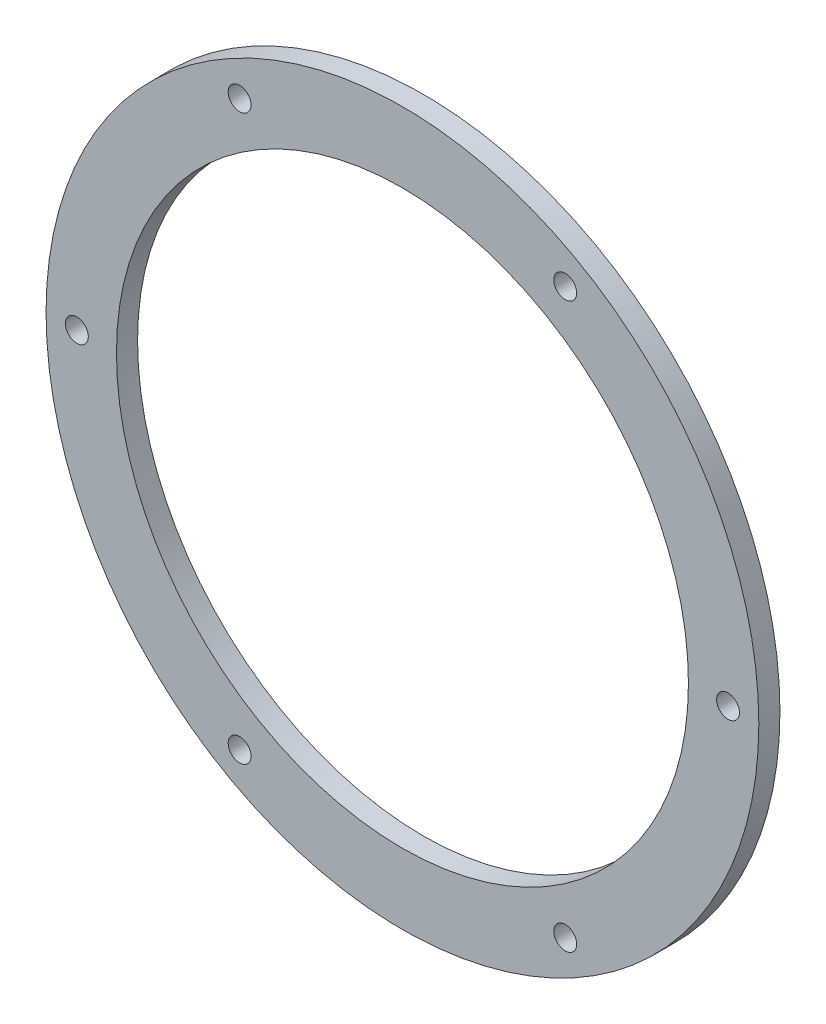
from build123d import *

# Parameters (mm, degrees)
SKETCH1_R           = 202.5
SKETCH1_R_2         = 162.5
BOSS_EXTRUDE1_DEPTH = 12
SKETCH2_R           = 6.5
CUT_EXTRUDE1_DEPTH  = 287.629551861
CIRPATTERN1_COUNT   = 6


with BuildPart() as part:
    # Sketch1 → Boss-Extrude1 (new body)
    with BuildSketch(Plane.XY):
        Circle(SKETCH1_R)
        Circle(SKETCH1_R_2, mode=Mode.SUBTRACT)
    extrude(amount=BOSS_EXTRUDE1_DEPTH)

    # Sketch2 → Cut-Extrude1 (cut, through all)
    with BuildSketch(Plane(origin=(0, 0, 0), x_dir=(-1, 0, 0), z_dir=(0, 0, -1))):
        with Locations((185, 0)):
            Circle(SKETCH2_R)
    cut_extrude1 = extrude(amount=-CUT_EXTRUDE1_DEPTH, mode=Mode.SUBTRACT)

    # CirPattern1: Cut-Extrude1 ×6 about axis
    cirpattern1_axis = Axis((0, 0, 0), (0, 0, 1))
    for i in range(1, CIRPATTERN1_COUNT):
        add(cut_extrude1.rotate(cirpattern1_axis, i * 360 / CIRPATTERN1_COUNT), mode=Mode.SUBTRACT)


solid = part.part
